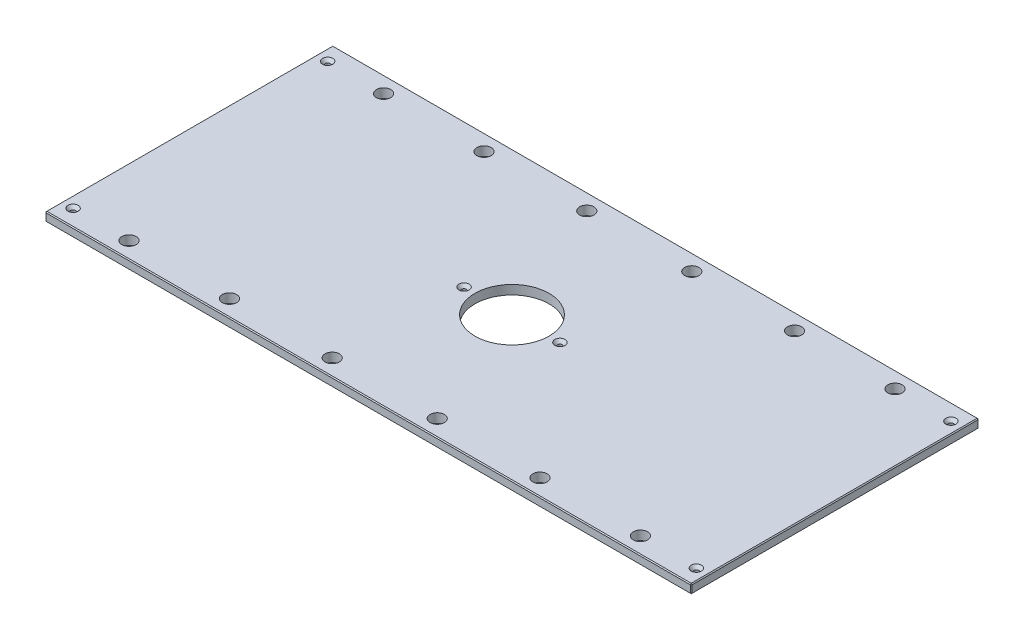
ISO-10303-21;
HEADER;
FILE_DESCRIPTION(('STEP AP214'),'2;1');
FILE_NAME('part.step','',(''),(''),'','','');
FILE_SCHEMA(('AUTOMOTIVE_DESIGN { 1 0 10303 214 1 1 1 1 }'));
ENDSEC;
DATA;
#1=APPLICATION_CONTEXT('core data for automotive mechanical design processes');
#2=APPLICATION_PROTOCOL_DEFINITION('international standard','automotive_design',2000,#1);
#3=PRODUCT_CONTEXT('',#1,'mechanical');
#4=PRODUCT('Part','Part','',(#3));
#5=PRODUCT_RELATED_PRODUCT_CATEGORY('part','',(#4));
#6=PRODUCT_DEFINITION_FORMATION('','',#4);
#7=PRODUCT_DEFINITION_CONTEXT('part definition',#1,'design');
#8=PRODUCT_DEFINITION('design','',#6,#7);
#9=PRODUCT_DEFINITION_SHAPE('','',#8);
#10=(LENGTH_UNIT() NAMED_UNIT(*) SI_UNIT(.MILLI.,.METRE.));
#11=(NAMED_UNIT(*) PLANE_ANGLE_UNIT() SI_UNIT($,.RADIAN.));
#12=(NAMED_UNIT(*) SI_UNIT($,.STERADIAN.) SOLID_ANGLE_UNIT());
#13=UNCERTAINTY_MEASURE_WITH_UNIT(LENGTH_MEASURE(1.E-05),#10,'distance_accuracy_value','');
#14=(GEOMETRIC_REPRESENTATION_CONTEXT(3) GLOBAL_UNCERTAINTY_ASSIGNED_CONTEXT((#13)) GLOBAL_UNIT_ASSIGNED_CONTEXT((#10,
#11,#12)) REPRESENTATION_CONTEXT('',''));
#15=CARTESIAN_POINT('',(0.,0.,0.));
#16=DIRECTION('',(0.,0.,1.));
#17=DIRECTION('',(1.,0.,0.));
#18=AXIS2_PLACEMENT_3D('',#15,#16,#17);
#19=CARTESIAN_POINT('',(-449.2625,12.7,-200.025));
#20=DIRECTION('',(1.,0.,0.));
#21=DIRECTION('',(0.,0.,-1.));
#22=AXIS2_PLACEMENT_3D('',#19,#20,#21);
#23=PLANE('',#22);
#24=DIRECTION('',(0.,0.,-1.));
#25=VECTOR('',#24,1.);
#26=CARTESIAN_POINT('',(-449.2625,11.4299999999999,-200.025));
#27=LINE('',#26,#25);
#28=CARTESIAN_POINT('',(-449.2625,11.4299999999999,198.755));
#29=VERTEX_POINT('',#28);
#30=CARTESIAN_POINT('',(-449.2625,11.4299999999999,-198.755));
#31=VERTEX_POINT('',#30);
#32=EDGE_CURVE('E135',#29,#31,#27,.T.);
#33=ORIENTED_EDGE('',*,*,#32,.T.);
#34=DIRECTION('',(0.,-1.,0.));
#35=VECTOR('',#34,1.);
#36=CARTESIAN_POINT('',(-449.2625,12.7,-198.755));
#37=LINE('',#36,#35);
#38=CARTESIAN_POINT('',(-449.2625,1.2700000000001,-198.755));
#39=VERTEX_POINT('',#38);
#40=EDGE_CURVE('E131',#31,#39,#37,.T.);
#41=ORIENTED_EDGE('',*,*,#40,.T.);
#42=DIRECTION('',(0.,0.,1.));
#43=VECTOR('',#42,1.);
#44=CARTESIAN_POINT('',(-449.2625,1.2700000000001,-200.025));
#45=LINE('',#44,#43);
#46=CARTESIAN_POINT('',(-449.2625,1.2700000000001,198.755));
#47=VERTEX_POINT('',#46);
#48=EDGE_CURVE('E126',#39,#47,#45,.T.);
#49=ORIENTED_EDGE('',*,*,#48,.T.);
#50=DIRECTION('',(0.,1.,0.));
#51=VECTOR('',#50,1.);
#52=CARTESIAN_POINT('',(-449.2625,12.7,198.755));
#53=LINE('',#52,#51);
#54=EDGE_CURVE('E128',#47,#29,#53,.T.);
#55=ORIENTED_EDGE('',*,*,#54,.T.);
#56=EDGE_LOOP('',(#33,#41,#49,#55));
#57=FACE_BOUND('',#56,.T.);
#58=ADVANCED_FACE('F35',(#57),#23,.F.);
#59=CARTESIAN_POINT('',(-449.2625,12.7,200.025));
#60=DIRECTION('',(0.,0.,-1.));
#61=DIRECTION('',(-1.,0.,0.));
#62=AXIS2_PLACEMENT_3D('',#59,#60,#61);
#63=PLANE('',#62);
#64=DIRECTION('',(1.,0.,0.));
#65=VECTOR('',#64,1.);
#66=CARTESIAN_POINT('',(-449.2625,1.2700000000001,200.025));
#67=LINE('',#66,#65);
#68=CARTESIAN_POINT('',(-447.9925,1.2700000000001,200.025));
#69=VERTEX_POINT('',#68);
#70=CARTESIAN_POINT('',(447.9925,1.2700000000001,200.025));
#71=VERTEX_POINT('',#70);
#72=EDGE_CURVE('E58',#69,#71,#67,.T.);
#73=ORIENTED_EDGE('',*,*,#72,.T.);
#74=DIRECTION('',(0.,1.,0.));
#75=VECTOR('',#74,1.);
#76=CARTESIAN_POINT('',(447.9925,12.7,200.025));
#77=LINE('',#76,#75);
#78=CARTESIAN_POINT('',(447.9925,11.4299999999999,200.025));
#79=VERTEX_POINT('',#78);
#80=EDGE_CURVE('E11',#71,#79,#77,.T.);
#81=ORIENTED_EDGE('',*,*,#80,.T.);
#82=DIRECTION('',(-1.,0.,0.));
#83=VECTOR('',#82,1.);
#84=CARTESIAN_POINT('',(-449.2625,11.4299999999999,200.025));
#85=LINE('',#84,#83);
#86=CARTESIAN_POINT('',(-447.9925,11.4299999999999,200.025));
#87=VERTEX_POINT('',#86);
#88=EDGE_CURVE('E44',#79,#87,#85,.T.);
#89=ORIENTED_EDGE('',*,*,#88,.T.);
#90=DIRECTION('',(0.,-1.,0.));
#91=VECTOR('',#90,1.);
#92=CARTESIAN_POINT('',(-447.9925,12.7,200.025));
#93=LINE('',#92,#91);
#94=EDGE_CURVE('E327',#87,#69,#93,.T.);
#95=ORIENTED_EDGE('',*,*,#94,.T.);
#96=EDGE_LOOP('',(#73,#81,#89,#95));
#97=FACE_BOUND('',#96,.T.);
#98=ADVANCED_FACE('F396',(#97),#63,.F.);
#99=CARTESIAN_POINT('',(449.2625,12.7,-200.025));
#100=DIRECTION('',(-1.,0.,0.));
#101=DIRECTION('',(0.,0.,1.));
#102=AXIS2_PLACEMENT_3D('',#99,#100,#101);
#103=PLANE('',#102);
#104=DIRECTION('',(0.,0.,-1.));
#105=VECTOR('',#104,1.);
#106=CARTESIAN_POINT('',(449.2625,1.2700000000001,-200.025));
#107=LINE('',#106,#105);
#108=CARTESIAN_POINT('',(449.2625,1.2700000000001,198.755));
#109=VERTEX_POINT('',#108);
#110=CARTESIAN_POINT('',(449.2625,1.2700000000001,-198.755));
#111=VERTEX_POINT('',#110);
#112=EDGE_CURVE('E322',#109,#111,#107,.T.);
#113=ORIENTED_EDGE('',*,*,#112,.T.);
#114=DIRECTION('',(0.,1.,0.));
#115=VECTOR('',#114,1.);
#116=CARTESIAN_POINT('',(449.2625,12.7,-198.755));
#117=LINE('',#116,#115);
#118=CARTESIAN_POINT('',(449.2625,11.4299999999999,-198.755));
#119=VERTEX_POINT('',#118);
#120=EDGE_CURVE('E324',#111,#119,#117,.T.);
#121=ORIENTED_EDGE('',*,*,#120,.T.);
#122=DIRECTION('',(0.,0.,1.));
#123=VECTOR('',#122,1.);
#124=CARTESIAN_POINT('',(449.2625,11.4299999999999,200.025));
#125=LINE('',#124,#123);
#126=CARTESIAN_POINT('',(449.2625,11.4299999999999,198.755));
#127=VERTEX_POINT('',#126);
#128=EDGE_CURVE('E320',#119,#127,#125,.T.);
#129=ORIENTED_EDGE('',*,*,#128,.T.);
#130=DIRECTION('',(0.,-1.,0.));
#131=VECTOR('',#130,1.);
#132=CARTESIAN_POINT('',(449.2625,12.7,198.755));
#133=LINE('',#132,#131);
#134=EDGE_CURVE('E318',#127,#109,#133,.T.);
#135=ORIENTED_EDGE('',*,*,#134,.T.);
#136=EDGE_LOOP('',(#113,#121,#129,#135));
#137=FACE_BOUND('',#136,.T.);
#138=ADVANCED_FACE('F383',(#137),#103,.F.);
#139=CARTESIAN_POINT('',(-449.2625,12.7,-200.025));
#140=DIRECTION('',(0.,0.,1.));
#141=DIRECTION('',(1.,0.,0.));
#142=AXIS2_PLACEMENT_3D('',#139,#140,#141);
#143=PLANE('',#142);
#144=DIRECTION('',(-1.,0.,0.));
#145=VECTOR('',#144,1.);
#146=CARTESIAN_POINT('',(-449.2625,1.2700000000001,-200.025));
#147=LINE('',#146,#145);
#148=CARTESIAN_POINT('',(447.9925,1.2700000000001,-200.025));
#149=VERTEX_POINT('',#148);
#150=CARTESIAN_POINT('',(-447.9925,1.2700000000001,-200.025));
#151=VERTEX_POINT('',#150);
#152=EDGE_CURVE('E294',#149,#151,#147,.T.);
#153=ORIENTED_EDGE('',*,*,#152,.T.);
#154=DIRECTION('',(0.,1.,0.));
#155=VECTOR('',#154,1.);
#156=CARTESIAN_POINT('',(-447.9925,12.7,-200.025));
#157=LINE('',#156,#155);
#158=CARTESIAN_POINT('',(-447.9925,11.4299999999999,-200.025));
#159=VERTEX_POINT('',#158);
#160=EDGE_CURVE('E298',#151,#159,#157,.T.);
#161=ORIENTED_EDGE('',*,*,#160,.T.);
#162=DIRECTION('',(1.,0.,0.));
#163=VECTOR('',#162,1.);
#164=CARTESIAN_POINT('',(449.2625,11.4299999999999,-200.025));
#165=LINE('',#164,#163);
#166=CARTESIAN_POINT('',(447.9925,11.4299999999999,-200.025));
#167=VERTEX_POINT('',#166);
#168=EDGE_CURVE('E296',#159,#167,#165,.T.);
#169=ORIENTED_EDGE('',*,*,#168,.T.);
#170=DIRECTION('',(0.,-1.,0.));
#171=VECTOR('',#170,1.);
#172=CARTESIAN_POINT('',(447.9925,12.7,-200.025));
#173=LINE('',#172,#171);
#174=EDGE_CURVE('E292',#167,#149,#173,.T.);
#175=ORIENTED_EDGE('',*,*,#174,.T.);
#176=EDGE_LOOP('',(#153,#161,#169,#175));
#177=FACE_BOUND('',#176,.T.);
#178=ADVANCED_FACE('F357',(#177),#143,.F.);
#179=CARTESIAN_POINT('',(0.,12.7,0.));
#180=DIRECTION('',(0.,1.,0.));
#181=DIRECTION('',(0.,0.,1.));
#182=AXIS2_PLACEMENT_3D('',#179,#180,#181);
#183=PLANE('',#182);
#184=CARTESIAN_POINT('',(433.3875,12.7,-177.00498));
#185=DIRECTION('',(0.,1.,0.));
#186=DIRECTION('',(0.,0.,1.));
#187=AXIS2_PLACEMENT_3D('',#184,#185,#186);
#188=CIRCLE('',#187,7.13740000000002);
#189=CARTESIAN_POINT('',(433.3875,12.7,-169.86758));
#190=VERTEX_POINT('',#189);
#191=EDGE_CURVE('E880',#190,#190,#188,.T.);
#192=ORIENTED_EDGE('',*,*,#191,.F.);
#193=EDGE_LOOP('',(#192));
#194=FACE_BOUND('',#193,.T.);
#195=CARTESIAN_POINT('',(433.3875,12.7,177.00498));
#196=DIRECTION('',(0.,1.,0.));
#197=DIRECTION('',(0.,0.,1.));
#198=AXIS2_PLACEMENT_3D('',#195,#196,#197);
#199=CIRCLE('',#198,7.13740000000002);
#200=CARTESIAN_POINT('',(433.3875,12.7,184.14238));
#201=VERTEX_POINT('',#200);
#202=EDGE_CURVE('E884',#201,#201,#199,.T.);
#203=ORIENTED_EDGE('',*,*,#202,.F.);
#204=EDGE_LOOP('',(#203));
#205=FACE_BOUND('',#204,.T.);
#206=CARTESIAN_POINT('',(-433.3875,12.7,177.00498));
#207=DIRECTION('',(0.,1.,0.));
#208=DIRECTION('',(0.,0.,1.));
#209=AXIS2_PLACEMENT_3D('',#206,#207,#208);
#210=CIRCLE('',#209,7.13740000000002);
#211=CARTESIAN_POINT('',(-433.3875,12.7,184.14238));
#212=VERTEX_POINT('',#211);
#213=EDGE_CURVE('E888',#212,#212,#210,.T.);
#214=ORIENTED_EDGE('',*,*,#213,.F.);
#215=EDGE_LOOP('',(#214));
#216=FACE_BOUND('',#215,.T.);
#217=CARTESIAN_POINT('',(-66.675,12.7,0.));
#218=DIRECTION('',(0.,1.,0.));
#219=DIRECTION('',(0.,0.,1.));
#220=AXIS2_PLACEMENT_3D('',#217,#218,#219);
#221=CIRCLE('',#220,7.1374);
#222=CARTESIAN_POINT('',(-66.675,12.7,7.1374));
#223=VERTEX_POINT('',#222);
#224=EDGE_CURVE('E892',#223,#223,#221,.T.);
#225=ORIENTED_EDGE('',*,*,#224,.F.);
#226=EDGE_LOOP('',(#225));
#227=FACE_BOUND('',#226,.T.);
#228=CARTESIAN_POINT('',(66.675,12.7,0.));
#229=DIRECTION('',(0.,1.,0.));
#230=DIRECTION('',(0.,0.,1.));
#231=AXIS2_PLACEMENT_3D('',#228,#229,#230);
#232=CIRCLE('',#231,7.1374);
#233=CARTESIAN_POINT('',(66.675,12.7,7.1374));
#234=VERTEX_POINT('',#233);
#235=EDGE_CURVE('E896',#234,#234,#232,.T.);
#236=ORIENTED_EDGE('',*,*,#235,.F.);
#237=EDGE_LOOP('',(#236));
#238=FACE_BOUND('',#237,.T.);
#239=CARTESIAN_POINT('',(-433.3875,12.7,-177.00498));
#240=DIRECTION('',(0.,1.,0.));
#241=DIRECTION('',(0.,0.,1.));
#242=AXIS2_PLACEMENT_3D('',#239,#240,#241);
#243=CIRCLE('',#242,7.13740000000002);
#244=CARTESIAN_POINT('',(-433.3875,12.7,-169.86758));
#245=VERTEX_POINT('',#244);
#246=EDGE_CURVE('E899',#245,#245,#243,.T.);
#247=ORIENTED_EDGE('',*,*,#246,.F.);
#248=EDGE_LOOP('',(#247));
#249=FACE_BOUND('',#248,.T.);
#250=DIRECTION('',(0.,0.,-1.));
#251=VECTOR('',#250,1.);
#252=CARTESIAN_POINT('',(447.9925,12.7,-200.025));
#253=LINE('',#252,#251);
#254=CARTESIAN_POINT('',(447.9925,12.7,198.755));
#255=VERTEX_POINT('',#254);
#256=CARTESIAN_POINT('',(447.9925,12.7,-198.755));
#257=VERTEX_POINT('',#256);
#258=EDGE_CURVE('E305',#255,#257,#253,.T.);
#259=ORIENTED_EDGE('',*,*,#258,.T.);
#260=DIRECTION('',(-1.,0.,0.));
#261=VECTOR('',#260,1.);
#262=CARTESIAN_POINT('',(-449.2625,12.7,-198.755));
#263=LINE('',#262,#261);
#264=CARTESIAN_POINT('',(-447.9925,12.7,-198.755));
#265=VERTEX_POINT('',#264);
#266=EDGE_CURVE('E307',#257,#265,#263,.T.);
#267=ORIENTED_EDGE('',*,*,#266,.T.);
#268=DIRECTION('',(0.,0.,1.));
#269=VECTOR('',#268,1.);
#270=CARTESIAN_POINT('',(-447.9925,12.7,200.025));
#271=LINE('',#270,#269);
#272=CARTESIAN_POINT('',(-447.9925,12.7,198.755));
#273=VERTEX_POINT('',#272);
#274=EDGE_CURVE('E303',#265,#273,#271,.T.);
#275=ORIENTED_EDGE('',*,*,#274,.T.);
#276=DIRECTION('',(1.,0.,0.));
#277=VECTOR('',#276,1.);
#278=CARTESIAN_POINT('',(449.2625,12.7,198.755));
#279=LINE('',#278,#277);
#280=EDGE_CURVE('E301',#273,#255,#279,.T.);
#281=ORIENTED_EDGE('',*,*,#280,.T.);
#282=EDGE_LOOP('',(#259,#267,#275,#281));
#283=FACE_BOUND('',#282,.T.);
#284=CARTESIAN_POINT('',(355.6,12.7,-177.00498));
#285=DIRECTION('',(0.,1.,0.));
#286=DIRECTION('',(0.,0.,1.));
#287=AXIS2_PLACEMENT_3D('',#284,#285,#286);
#288=CIRCLE('',#287,9.92187500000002);
#289=CARTESIAN_POINT('',(355.6,12.7,-167.083105));
#290=VERTEX_POINT('',#289);
#291=EDGE_CURVE('E204',#290,#290,#288,.T.);
#292=ORIENTED_EDGE('',*,*,#291,.F.);
#293=EDGE_LOOP('',(#292));
#294=FACE_BOUND('',#293,.T.);
#295=CARTESIAN_POINT('',(-355.6,12.7,-177.00498));
#296=DIRECTION('',(0.,1.,0.));
#297=DIRECTION('',(0.,0.,1.));
#298=AXIS2_PLACEMENT_3D('',#295,#296,#297);
#299=CIRCLE('',#298,9.92187500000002);
#300=CARTESIAN_POINT('',(-355.6,12.7,-167.083105));
#301=VERTEX_POINT('',#300);
#302=EDGE_CURVE('E214',#301,#301,#299,.T.);
#303=ORIENTED_EDGE('',*,*,#302,.F.);
#304=EDGE_LOOP('',(#303));
#305=FACE_BOUND('',#304,.T.);
#306=CARTESIAN_POINT('',(355.6,12.7,177.00498));
#307=DIRECTION('',(0.,1.,0.));
#308=DIRECTION('',(0.,0.,1.));
#309=AXIS2_PLACEMENT_3D('',#306,#307,#308);
#310=CIRCLE('',#309,9.92187500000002);
#311=CARTESIAN_POINT('',(355.6,12.7,186.926855));
#312=VERTEX_POINT('',#311);
#313=EDGE_CURVE('E225',#312,#312,#310,.T.);
#314=ORIENTED_EDGE('',*,*,#313,.F.);
#315=EDGE_LOOP('',(#314));
#316=FACE_BOUND('',#315,.T.);
#317=CARTESIAN_POINT('',(-355.6,12.7,177.00498));
#318=DIRECTION('',(0.,1.,0.));
#319=DIRECTION('',(0.,0.,1.));
#320=AXIS2_PLACEMENT_3D('',#317,#318,#319);
#321=CIRCLE('',#320,9.92187500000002);
#322=CARTESIAN_POINT('',(-355.6,12.7,186.926855));
#323=VERTEX_POINT('',#322);
#324=EDGE_CURVE('E231',#323,#323,#321,.T.);
#325=ORIENTED_EDGE('',*,*,#324,.F.);
#326=EDGE_LOOP('',(#325));
#327=FACE_BOUND('',#326,.T.);
#328=CARTESIAN_POINT('',(-215.9,12.7,-177.00498));
#329=DIRECTION('',(0.,1.,0.));
#330=DIRECTION('',(0.,0.,1.));
#331=AXIS2_PLACEMENT_3D('',#328,#329,#330);
#332=CIRCLE('',#331,9.921875);
#333=CARTESIAN_POINT('',(-215.9,12.7,-167.083105));
#334=VERTEX_POINT('',#333);
#335=EDGE_CURVE('E237',#334,#334,#332,.T.);
#336=ORIENTED_EDGE('',*,*,#335,.F.);
#337=EDGE_LOOP('',(#336));
#338=FACE_BOUND('',#337,.T.);
#339=CARTESIAN_POINT('',(215.9,12.7,-177.00498));
#340=DIRECTION('',(0.,1.,0.));
#341=DIRECTION('',(0.,0.,1.));
#342=AXIS2_PLACEMENT_3D('',#339,#340,#341);
#343=CIRCLE('',#342,9.921875);
#344=CARTESIAN_POINT('',(215.9,12.7,-167.083105));
#345=VERTEX_POINT('',#344);
#346=EDGE_CURVE('E243',#345,#345,#343,.T.);
#347=ORIENTED_EDGE('',*,*,#346,.F.);
#348=EDGE_LOOP('',(#347));
#349=FACE_BOUND('',#348,.T.);
#350=CARTESIAN_POINT('',(215.9,12.7,177.00498));
#351=DIRECTION('',(0.,1.,0.));
#352=DIRECTION('',(0.,0.,1.));
#353=AXIS2_PLACEMENT_3D('',#350,#351,#352);
#354=CIRCLE('',#353,9.921875);
#355=CARTESIAN_POINT('',(215.9,12.7,186.926855));
#356=VERTEX_POINT('',#355);
#357=EDGE_CURVE('E249',#356,#356,#354,.T.);
#358=ORIENTED_EDGE('',*,*,#357,.F.);
#359=EDGE_LOOP('',(#358));
#360=FACE_BOUND('',#359,.T.);
#361=CARTESIAN_POINT('',(-215.9,12.7,177.00498));
#362=DIRECTION('',(0.,1.,0.));
#363=DIRECTION('',(0.,0.,1.));
#364=AXIS2_PLACEMENT_3D('',#361,#362,#363);
#365=CIRCLE('',#364,9.921875);
#366=CARTESIAN_POINT('',(-215.9,12.7,186.926855));
#367=VERTEX_POINT('',#366);
#368=EDGE_CURVE('E255',#367,#367,#365,.T.);
#369=ORIENTED_EDGE('',*,*,#368,.F.);
#370=EDGE_LOOP('',(#369));
#371=FACE_BOUND('',#370,.T.);
#372=CARTESIAN_POINT('',(73.025,12.7,-177.00498));
#373=DIRECTION('',(0.,1.,0.));
#374=DIRECTION('',(0.,0.,1.));
#375=AXIS2_PLACEMENT_3D('',#372,#373,#374);
#376=CIRCLE('',#375,9.921875);
#377=CARTESIAN_POINT('',(73.025,12.7,-167.083105));
#378=VERTEX_POINT('',#377);
#379=EDGE_CURVE('E261',#378,#378,#376,.T.);
#380=ORIENTED_EDGE('',*,*,#379,.F.);
#381=EDGE_LOOP('',(#380));
#382=FACE_BOUND('',#381,.T.);
#383=CARTESIAN_POINT('',(-73.025,12.7,-177.00498));
#384=DIRECTION('',(0.,1.,0.));
#385=DIRECTION('',(0.,0.,1.));
#386=AXIS2_PLACEMENT_3D('',#383,#384,#385);
#387=CIRCLE('',#386,9.921875);
#388=CARTESIAN_POINT('',(-73.025,12.7,-167.083105));
#389=VERTEX_POINT('',#388);
#390=EDGE_CURVE('E267',#389,#389,#387,.T.);
#391=ORIENTED_EDGE('',*,*,#390,.F.);
#392=EDGE_LOOP('',(#391));
#393=FACE_BOUND('',#392,.T.);
#394=CARTESIAN_POINT('',(-73.025,12.7,177.00498));
#395=DIRECTION('',(0.,1.,0.));
#396=DIRECTION('',(0.,0.,1.));
#397=AXIS2_PLACEMENT_3D('',#394,#395,#396);
#398=CIRCLE('',#397,9.921875);
#399=CARTESIAN_POINT('',(-73.025,12.7,186.926855));
#400=VERTEX_POINT('',#399);
#401=EDGE_CURVE('E273',#400,#400,#398,.T.);
#402=ORIENTED_EDGE('',*,*,#401,.F.);
#403=EDGE_LOOP('',(#402));
#404=FACE_BOUND('',#403,.T.);
#405=CARTESIAN_POINT('',(73.025,12.7,177.00498));
#406=DIRECTION('',(0.,1.,0.));
#407=DIRECTION('',(0.,0.,1.));
#408=AXIS2_PLACEMENT_3D('',#405,#406,#407);
#409=CIRCLE('',#408,9.921875);
#410=CARTESIAN_POINT('',(73.025,12.7,186.926855));
#411=VERTEX_POINT('',#410);
#412=EDGE_CURVE('E279',#411,#411,#409,.T.);
#413=ORIENTED_EDGE('',*,*,#412,.F.);
#414=EDGE_LOOP('',(#413));
#415=FACE_BOUND('',#414,.T.);
#416=CARTESIAN_POINT('',(0.,12.7,0.));
#417=DIRECTION('',(0.,1.,0.));
#418=DIRECTION('',(0.,0.,1.));
#419=AXIS2_PLACEMENT_3D('',#416,#417,#418);
#420=CIRCLE('',#419,51.562);
#421=CARTESIAN_POINT('',(0.,12.7,51.562));
#422=VERTEX_POINT('',#421);
#423=EDGE_CURVE('E285',#422,#422,#420,.T.);
#424=ORIENTED_EDGE('',*,*,#423,.F.);
#425=EDGE_LOOP('',(#424));
#426=FACE_BOUND('',#425,.T.);
#427=ADVANCED_FACE('F405',(#194,#205,#216,#227,#238,#249,#283,#294,#305,#316,#327,#338,#349,
#360,#371,#382,#393,#404,#415,#426),#183,.T.);
#428=CARTESIAN_POINT('',(0.,0.,0.));
#429=DIRECTION('',(0.,1.,0.));
#430=DIRECTION('',(0.,0.,1.));
#431=AXIS2_PLACEMENT_3D('',#428,#429,#430);
#432=PLANE('',#431);
#433=CARTESIAN_POINT('',(433.3875,0.,-177.00498));
#434=DIRECTION('',(0.,1.,0.));
#435=DIRECTION('',(0.,0.,1.));
#436=AXIS2_PLACEMENT_3D('',#433,#434,#435);
#437=CIRCLE('',#436,3.3782);
#438=CARTESIAN_POINT('',(433.3875,0.,-173.62678));
#439=VERTEX_POINT('',#438);
#440=EDGE_CURVE('E933',#439,#439,#437,.T.);
#441=ORIENTED_EDGE('',*,*,#440,.T.);
#442=EDGE_LOOP('',(#441));
#443=FACE_BOUND('',#442,.T.);
#444=CARTESIAN_POINT('',(433.3875,0.,177.00498));
#445=DIRECTION('',(0.,1.,0.));
#446=DIRECTION('',(0.,0.,1.));
#447=AXIS2_PLACEMENT_3D('',#444,#445,#446);
#448=CIRCLE('',#447,3.3782);
#449=CARTESIAN_POINT('',(433.3875,0.,180.38318));
#450=VERTEX_POINT('',#449);
#451=EDGE_CURVE('E926',#450,#450,#448,.T.);
#452=ORIENTED_EDGE('',*,*,#451,.T.);
#453=EDGE_LOOP('',(#452));
#454=FACE_BOUND('',#453,.T.);
#455=CARTESIAN_POINT('',(-433.3875,0.,177.00498));
#456=DIRECTION('',(0.,1.,0.));
#457=DIRECTION('',(0.,0.,1.));
#458=AXIS2_PLACEMENT_3D('',#455,#456,#457);
#459=CIRCLE('',#458,3.3782);
#460=CARTESIAN_POINT('',(-433.3875,0.,180.38318));
#461=VERTEX_POINT('',#460);
#462=EDGE_CURVE('E919',#461,#461,#459,.T.);
#463=ORIENTED_EDGE('',*,*,#462,.T.);
#464=EDGE_LOOP('',(#463));
#465=FACE_BOUND('',#464,.T.);
#466=CARTESIAN_POINT('',(-66.675,0.,0.));
#467=DIRECTION('',(0.,1.,0.));
#468=DIRECTION('',(0.,0.,1.));
#469=AXIS2_PLACEMENT_3D('',#466,#467,#468);
#470=CIRCLE('',#469,3.3782);
#471=CARTESIAN_POINT('',(-66.675,0.,3.3782));
#472=VERTEX_POINT('',#471);
#473=EDGE_CURVE('E912',#472,#472,#470,.T.);
#474=ORIENTED_EDGE('',*,*,#473,.T.);
#475=EDGE_LOOP('',(#474));
#476=FACE_BOUND('',#475,.T.);
#477=CARTESIAN_POINT('',(66.675,0.,0.));
#478=DIRECTION('',(0.,1.,0.));
#479=DIRECTION('',(0.,0.,1.));
#480=AXIS2_PLACEMENT_3D('',#477,#478,#479);
#481=CIRCLE('',#480,3.3782);
#482=CARTESIAN_POINT('',(66.675,0.,3.3782));
#483=VERTEX_POINT('',#482);
#484=EDGE_CURVE('E902',#483,#483,#481,.T.);
#485=ORIENTED_EDGE('',*,*,#484,.T.);
#486=EDGE_LOOP('',(#485));
#487=FACE_BOUND('',#486,.T.);
#488=CARTESIAN_POINT('',(-433.3875,0.,-177.00498));
#489=DIRECTION('',(0.,1.,0.));
#490=DIRECTION('',(0.,0.,1.));
#491=AXIS2_PLACEMENT_3D('',#488,#489,#490);
#492=CIRCLE('',#491,3.3782);
#493=CARTESIAN_POINT('',(-433.3875,0.,-173.62678));
#494=VERTEX_POINT('',#493);
#495=EDGE_CURVE('E217',#494,#494,#492,.T.);
#496=ORIENTED_EDGE('',*,*,#495,.T.);
#497=EDGE_LOOP('',(#496));
#498=FACE_BOUND('',#497,.T.);
#499=DIRECTION('',(0.,0.,-1.));
#500=VECTOR('',#499,1.);
#501=CARTESIAN_POINT('',(-447.9925,0.,0.));
#502=LINE('',#501,#500);
#503=CARTESIAN_POINT('',(-447.9925,0.,198.755));
#504=VERTEX_POINT('',#503);
#505=CARTESIAN_POINT('',(-447.9925,0.,-198.755));
#506=VERTEX_POINT('',#505);
#507=EDGE_CURVE('E158',#504,#506,#502,.T.);
#508=ORIENTED_EDGE('',*,*,#507,.T.);
#509=DIRECTION('',(1.,0.,0.));
#510=VECTOR('',#509,1.);
#511=CARTESIAN_POINT('',(0.,0.,-198.755));
#512=LINE('',#511,#510);
#513=CARTESIAN_POINT('',(447.9925,0.,-198.755));
#514=VERTEX_POINT('',#513);
#515=EDGE_CURVE('E315',#506,#514,#512,.T.);
#516=ORIENTED_EDGE('',*,*,#515,.T.);
#517=DIRECTION('',(0.,0.,1.));
#518=VECTOR('',#517,1.);
#519=CARTESIAN_POINT('',(447.9925,0.,0.));
#520=LINE('',#519,#518);
#521=CARTESIAN_POINT('',(447.9925,0.,198.755));
#522=VERTEX_POINT('',#521);
#523=EDGE_CURVE('E313',#514,#522,#520,.T.);
#524=ORIENTED_EDGE('',*,*,#523,.T.);
#525=DIRECTION('',(-1.,0.,0.));
#526=VECTOR('',#525,1.);
#527=CARTESIAN_POINT('',(0.,0.,198.755));
#528=LINE('',#527,#526);
#529=EDGE_CURVE('E310',#522,#504,#528,.T.);
#530=ORIENTED_EDGE('',*,*,#529,.T.);
#531=EDGE_LOOP('',(#508,#516,#524,#530));
#532=FACE_BOUND('',#531,.T.);
#533=CARTESIAN_POINT('',(355.6,0.,-177.00498));
#534=DIRECTION('',(0.,1.,0.));
#535=DIRECTION('',(0.,0.,1.));
#536=AXIS2_PLACEMENT_3D('',#533,#534,#535);
#537=CIRCLE('',#536,9.92187500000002);
#538=CARTESIAN_POINT('',(355.6,0.,-167.083105));
#539=VERTEX_POINT('',#538);
#540=EDGE_CURVE('E209',#539,#539,#537,.T.);
#541=ORIENTED_EDGE('',*,*,#540,.T.);
#542=EDGE_LOOP('',(#541));
#543=FACE_BOUND('',#542,.T.);
#544=CARTESIAN_POINT('',(-355.6,0.,-177.00498));
#545=DIRECTION('',(0.,1.,0.));
#546=DIRECTION('',(0.,0.,1.));
#547=AXIS2_PLACEMENT_3D('',#544,#545,#546);
#548=CIRCLE('',#547,9.92187500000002);
#549=CARTESIAN_POINT('',(-355.6,0.,-167.083105));
#550=VERTEX_POINT('',#549);
#551=EDGE_CURVE('E222',#550,#550,#548,.T.);
#552=ORIENTED_EDGE('',*,*,#551,.T.);
#553=EDGE_LOOP('',(#552));
#554=FACE_BOUND('',#553,.T.);
#555=CARTESIAN_POINT('',(355.6,0.,177.00498));
#556=DIRECTION('',(0.,1.,0.));
#557=DIRECTION('',(0.,0.,1.));
#558=AXIS2_PLACEMENT_3D('',#555,#556,#557);
#559=CIRCLE('',#558,9.92187500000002);
#560=CARTESIAN_POINT('',(355.6,0.,186.926855));
#561=VERTEX_POINT('',#560);
#562=EDGE_CURVE('E228',#561,#561,#559,.T.);
#563=ORIENTED_EDGE('',*,*,#562,.T.);
#564=EDGE_LOOP('',(#563));
#565=FACE_BOUND('',#564,.T.);
#566=CARTESIAN_POINT('',(-355.6,0.,177.00498));
#567=DIRECTION('',(0.,1.,0.));
#568=DIRECTION('',(0.,0.,1.));
#569=AXIS2_PLACEMENT_3D('',#566,#567,#568);
#570=CIRCLE('',#569,9.92187500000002);
#571=CARTESIAN_POINT('',(-355.6,0.,186.926855));
#572=VERTEX_POINT('',#571);
#573=EDGE_CURVE('E234',#572,#572,#570,.T.);
#574=ORIENTED_EDGE('',*,*,#573,.T.);
#575=EDGE_LOOP('',(#574));
#576=FACE_BOUND('',#575,.T.);
#577=CARTESIAN_POINT('',(-215.9,0.,-177.00498));
#578=DIRECTION('',(0.,1.,0.));
#579=DIRECTION('',(0.,0.,1.));
#580=AXIS2_PLACEMENT_3D('',#577,#578,#579);
#581=CIRCLE('',#580,9.921875);
#582=CARTESIAN_POINT('',(-215.9,0.,-167.083105));
#583=VERTEX_POINT('',#582);
#584=EDGE_CURVE('E240',#583,#583,#581,.T.);
#585=ORIENTED_EDGE('',*,*,#584,.T.);
#586=EDGE_LOOP('',(#585));
#587=FACE_BOUND('',#586,.T.);
#588=CARTESIAN_POINT('',(215.9,0.,-177.00498));
#589=DIRECTION('',(0.,1.,0.));
#590=DIRECTION('',(0.,0.,1.));
#591=AXIS2_PLACEMENT_3D('',#588,#589,#590);
#592=CIRCLE('',#591,9.921875);
#593=CARTESIAN_POINT('',(215.9,0.,-167.083105));
#594=VERTEX_POINT('',#593);
#595=EDGE_CURVE('E246',#594,#594,#592,.T.);
#596=ORIENTED_EDGE('',*,*,#595,.T.);
#597=EDGE_LOOP('',(#596));
#598=FACE_BOUND('',#597,.T.);
#599=CARTESIAN_POINT('',(215.9,0.,177.00498));
#600=DIRECTION('',(0.,1.,0.));
#601=DIRECTION('',(0.,0.,1.));
#602=AXIS2_PLACEMENT_3D('',#599,#600,#601);
#603=CIRCLE('',#602,9.921875);
#604=CARTESIAN_POINT('',(215.9,0.,186.926855));
#605=VERTEX_POINT('',#604);
#606=EDGE_CURVE('E252',#605,#605,#603,.T.);
#607=ORIENTED_EDGE('',*,*,#606,.T.);
#608=EDGE_LOOP('',(#607));
#609=FACE_BOUND('',#608,.T.);
#610=CARTESIAN_POINT('',(-215.9,0.,177.00498));
#611=DIRECTION('',(0.,1.,0.));
#612=DIRECTION('',(0.,0.,1.));
#613=AXIS2_PLACEMENT_3D('',#610,#611,#612);
#614=CIRCLE('',#613,9.921875);
#615=CARTESIAN_POINT('',(-215.9,0.,186.926855));
#616=VERTEX_POINT('',#615);
#617=EDGE_CURVE('E258',#616,#616,#614,.T.);
#618=ORIENTED_EDGE('',*,*,#617,.T.);
#619=EDGE_LOOP('',(#618));
#620=FACE_BOUND('',#619,.T.);
#621=CARTESIAN_POINT('',(73.025,0.,-177.00498));
#622=DIRECTION('',(0.,1.,0.));
#623=DIRECTION('',(0.,0.,1.));
#624=AXIS2_PLACEMENT_3D('',#621,#622,#623);
#625=CIRCLE('',#624,9.921875);
#626=CARTESIAN_POINT('',(73.025,0.,-167.083105));
#627=VERTEX_POINT('',#626);
#628=EDGE_CURVE('E264',#627,#627,#625,.T.);
#629=ORIENTED_EDGE('',*,*,#628,.T.);
#630=EDGE_LOOP('',(#629));
#631=FACE_BOUND('',#630,.T.);
#632=CARTESIAN_POINT('',(-73.025,0.,-177.00498));
#633=DIRECTION('',(0.,1.,0.));
#634=DIRECTION('',(0.,0.,1.));
#635=AXIS2_PLACEMENT_3D('',#632,#633,#634);
#636=CIRCLE('',#635,9.921875);
#637=CARTESIAN_POINT('',(-73.025,0.,-167.083105));
#638=VERTEX_POINT('',#637);
#639=EDGE_CURVE('E270',#638,#638,#636,.T.);
#640=ORIENTED_EDGE('',*,*,#639,.T.);
#641=EDGE_LOOP('',(#640));
#642=FACE_BOUND('',#641,.T.);
#643=CARTESIAN_POINT('',(-73.025,0.,177.00498));
#644=DIRECTION('',(0.,1.,0.));
#645=DIRECTION('',(0.,0.,1.));
#646=AXIS2_PLACEMENT_3D('',#643,#644,#645);
#647=CIRCLE('',#646,9.921875);
#648=CARTESIAN_POINT('',(-73.025,0.,186.926855));
#649=VERTEX_POINT('',#648);
#650=EDGE_CURVE('E276',#649,#649,#647,.T.);
#651=ORIENTED_EDGE('',*,*,#650,.T.);
#652=EDGE_LOOP('',(#651));
#653=FACE_BOUND('',#652,.T.);
#654=CARTESIAN_POINT('',(73.025,0.,177.00498));
#655=DIRECTION('',(0.,1.,0.));
#656=DIRECTION('',(0.,0.,1.));
#657=AXIS2_PLACEMENT_3D('',#654,#655,#656);
#658=CIRCLE('',#657,9.921875);
#659=CARTESIAN_POINT('',(73.025,0.,186.926855));
#660=VERTEX_POINT('',#659);
#661=EDGE_CURVE('E282',#660,#660,#658,.T.);
#662=ORIENTED_EDGE('',*,*,#661,.T.);
#663=EDGE_LOOP('',(#662));
#664=FACE_BOUND('',#663,.T.);
#665=CARTESIAN_POINT('',(0.,0.,0.));
#666=DIRECTION('',(0.,1.,0.));
#667=DIRECTION('',(0.,0.,1.));
#668=AXIS2_PLACEMENT_3D('',#665,#666,#667);
#669=CIRCLE('',#668,51.562);
#670=CARTESIAN_POINT('',(0.,0.,51.562));
#671=VERTEX_POINT('',#670);
#672=EDGE_CURVE('E147',#671,#671,#669,.T.);
#673=ORIENTED_EDGE('',*,*,#672,.T.);
#674=EDGE_LOOP('',(#673));
#675=FACE_BOUND('',#674,.T.);
#676=ADVANCED_FACE('F370',(#443,#454,#465,#476,#487,#498,#532,#543,#554,#565,#576,#587,#598,
#609,#620,#631,#642,#653,#664,#675),#432,.F.);
#677=CARTESIAN_POINT('',(0.,0.,0.));
#678=DIRECTION('',(0.,1.,0.));
#679=DIRECTION('',(0.,0.,1.));
#680=AXIS2_PLACEMENT_3D('',#677,#678,#679);
#681=CYLINDRICAL_SURFACE('',#680,51.562);
#682=ORIENTED_EDGE('',*,*,#672,.F.);
#683=EDGE_LOOP('',(#682));
#684=FACE_BOUND('',#683,.T.);
#685=ORIENTED_EDGE('',*,*,#423,.T.);
#686=EDGE_LOOP('',(#685));
#687=FACE_BOUND('',#686,.T.);
#688=ADVANCED_FACE('F811',(#684,#687),#681,.F.);
#689=CARTESIAN_POINT('',(73.025,12.7,177.00498));
#690=DIRECTION('',(0.,1.,0.));
#691=DIRECTION('',(0.,0.,1.));
#692=AXIS2_PLACEMENT_3D('',#689,#690,#691);
#693=CYLINDRICAL_SURFACE('',#692,9.921875);
#694=ORIENTED_EDGE('',*,*,#661,.F.);
#695=EDGE_LOOP('',(#694));
#696=FACE_BOUND('',#695,.T.);
#697=ORIENTED_EDGE('',*,*,#412,.T.);
#698=EDGE_LOOP('',(#697));
#699=FACE_BOUND('',#698,.T.);
#700=ADVANCED_FACE('F802',(#696,#699),#693,.F.);
#701=CARTESIAN_POINT('',(-73.025,12.7,177.00498));
#702=DIRECTION('',(0.,1.,0.));
#703=DIRECTION('',(0.,0.,1.));
#704=AXIS2_PLACEMENT_3D('',#701,#702,#703);
#705=CYLINDRICAL_SURFACE('',#704,9.921875);
#706=ORIENTED_EDGE('',*,*,#650,.F.);
#707=EDGE_LOOP('',(#706));
#708=FACE_BOUND('',#707,.T.);
#709=ORIENTED_EDGE('',*,*,#401,.T.);
#710=EDGE_LOOP('',(#709));
#711=FACE_BOUND('',#710,.T.);
#712=ADVANCED_FACE('F793',(#708,#711),#705,.F.);
#713=CARTESIAN_POINT('',(-73.025,12.7,-177.00498));
#714=DIRECTION('',(0.,1.,0.));
#715=DIRECTION('',(0.,0.,1.));
#716=AXIS2_PLACEMENT_3D('',#713,#714,#715);
#717=CYLINDRICAL_SURFACE('',#716,9.921875);
#718=ORIENTED_EDGE('',*,*,#639,.F.);
#719=EDGE_LOOP('',(#718));
#720=FACE_BOUND('',#719,.T.);
#721=ORIENTED_EDGE('',*,*,#390,.T.);
#722=EDGE_LOOP('',(#721));
#723=FACE_BOUND('',#722,.T.);
#724=ADVANCED_FACE('F784',(#720,#723),#717,.F.);
#725=CARTESIAN_POINT('',(73.025,12.7,-177.00498));
#726=DIRECTION('',(0.,1.,0.));
#727=DIRECTION('',(0.,0.,1.));
#728=AXIS2_PLACEMENT_3D('',#725,#726,#727);
#729=CYLINDRICAL_SURFACE('',#728,9.921875);
#730=ORIENTED_EDGE('',*,*,#628,.F.);
#731=EDGE_LOOP('',(#730));
#732=FACE_BOUND('',#731,.T.);
#733=ORIENTED_EDGE('',*,*,#379,.T.);
#734=EDGE_LOOP('',(#733));
#735=FACE_BOUND('',#734,.T.);
#736=ADVANCED_FACE('F775',(#732,#735),#729,.F.);
#737=CARTESIAN_POINT('',(-215.9,12.7,177.00498));
#738=DIRECTION('',(0.,1.,0.));
#739=DIRECTION('',(0.,0.,1.));
#740=AXIS2_PLACEMENT_3D('',#737,#738,#739);
#741=CYLINDRICAL_SURFACE('',#740,9.921875);
#742=ORIENTED_EDGE('',*,*,#617,.F.);
#743=EDGE_LOOP('',(#742));
#744=FACE_BOUND('',#743,.T.);
#745=ORIENTED_EDGE('',*,*,#368,.T.);
#746=EDGE_LOOP('',(#745));
#747=FACE_BOUND('',#746,.T.);
#748=ADVANCED_FACE('F766',(#744,#747),#741,.F.);
#749=CARTESIAN_POINT('',(215.9,12.7,177.00498));
#750=DIRECTION('',(0.,1.,0.));
#751=DIRECTION('',(0.,0.,1.));
#752=AXIS2_PLACEMENT_3D('',#749,#750,#751);
#753=CYLINDRICAL_SURFACE('',#752,9.921875);
#754=ORIENTED_EDGE('',*,*,#606,.F.);
#755=EDGE_LOOP('',(#754));
#756=FACE_BOUND('',#755,.T.);
#757=ORIENTED_EDGE('',*,*,#357,.T.);
#758=EDGE_LOOP('',(#757));
#759=FACE_BOUND('',#758,.T.);
#760=ADVANCED_FACE('F757',(#756,#759),#753,.F.);
#761=CARTESIAN_POINT('',(215.9,12.7,-177.00498));
#762=DIRECTION('',(0.,1.,0.));
#763=DIRECTION('',(0.,0.,1.));
#764=AXIS2_PLACEMENT_3D('',#761,#762,#763);
#765=CYLINDRICAL_SURFACE('',#764,9.921875);
#766=ORIENTED_EDGE('',*,*,#595,.F.);
#767=EDGE_LOOP('',(#766));
#768=FACE_BOUND('',#767,.T.);
#769=ORIENTED_EDGE('',*,*,#346,.T.);
#770=EDGE_LOOP('',(#769));
#771=FACE_BOUND('',#770,.T.);
#772=ADVANCED_FACE('F748',(#768,#771),#765,.F.);
#773=CARTESIAN_POINT('',(-215.9,12.7,-177.00498));
#774=DIRECTION('',(0.,1.,0.));
#775=DIRECTION('',(0.,0.,1.));
#776=AXIS2_PLACEMENT_3D('',#773,#774,#775);
#777=CYLINDRICAL_SURFACE('',#776,9.921875);
#778=ORIENTED_EDGE('',*,*,#584,.F.);
#779=EDGE_LOOP('',(#778));
#780=FACE_BOUND('',#779,.T.);
#781=ORIENTED_EDGE('',*,*,#335,.T.);
#782=EDGE_LOOP('',(#781));
#783=FACE_BOUND('',#782,.T.);
#784=ADVANCED_FACE('F739',(#780,#783),#777,.F.);
#785=CARTESIAN_POINT('',(-355.6,12.7,177.00498));
#786=DIRECTION('',(0.,1.,0.));
#787=DIRECTION('',(0.,0.,1.));
#788=AXIS2_PLACEMENT_3D('',#785,#786,#787);
#789=CYLINDRICAL_SURFACE('',#788,9.92187500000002);
#790=ORIENTED_EDGE('',*,*,#573,.F.);
#791=EDGE_LOOP('',(#790));
#792=FACE_BOUND('',#791,.T.);
#793=ORIENTED_EDGE('',*,*,#324,.T.);
#794=EDGE_LOOP('',(#793));
#795=FACE_BOUND('',#794,.T.);
#796=ADVANCED_FACE('F730',(#792,#795),#789,.F.);
#797=CARTESIAN_POINT('',(355.6,12.7,177.00498));
#798=DIRECTION('',(0.,1.,0.));
#799=DIRECTION('',(0.,0.,1.));
#800=AXIS2_PLACEMENT_3D('',#797,#798,#799);
#801=CYLINDRICAL_SURFACE('',#800,9.92187500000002);
#802=ORIENTED_EDGE('',*,*,#562,.F.);
#803=EDGE_LOOP('',(#802));
#804=FACE_BOUND('',#803,.T.);
#805=ORIENTED_EDGE('',*,*,#313,.T.);
#806=EDGE_LOOP('',(#805));
#807=FACE_BOUND('',#806,.T.);
#808=ADVANCED_FACE('F721',(#804,#807),#801,.F.);
#809=CARTESIAN_POINT('',(-355.6,12.7,-177.00498));
#810=DIRECTION('',(0.,1.,0.));
#811=DIRECTION('',(0.,0.,1.));
#812=AXIS2_PLACEMENT_3D('',#809,#810,#811);
#813=CYLINDRICAL_SURFACE('',#812,9.92187500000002);
#814=ORIENTED_EDGE('',*,*,#551,.F.);
#815=EDGE_LOOP('',(#814));
#816=FACE_BOUND('',#815,.T.);
#817=ORIENTED_EDGE('',*,*,#302,.T.);
#818=EDGE_LOOP('',(#817));
#819=FACE_BOUND('',#818,.T.);
#820=ADVANCED_FACE('F711',(#816,#819),#813,.F.);
#821=CARTESIAN_POINT('',(355.6,12.7,-177.00498));
#822=DIRECTION('',(0.,1.,0.));
#823=DIRECTION('',(0.,0.,1.));
#824=AXIS2_PLACEMENT_3D('',#821,#822,#823);
#825=CYLINDRICAL_SURFACE('',#824,9.92187500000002);
#826=ORIENTED_EDGE('',*,*,#540,.F.);
#827=EDGE_LOOP('',(#826));
#828=FACE_BOUND('',#827,.T.);
#829=ORIENTED_EDGE('',*,*,#291,.T.);
#830=EDGE_LOOP('',(#829));
#831=FACE_BOUND('',#830,.T.);
#832=ADVANCED_FACE('F414',(#828,#831),#825,.F.);
#833=CARTESIAN_POINT('',(449.2625,12.7,198.755));
#834=DIRECTION('',(-0.707106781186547,0.,-0.707106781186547));
#835=DIRECTION('',(0.,-1.,0.));
#836=AXIS2_PLACEMENT_3D('',#833,#834,#835);
#837=PLANE('',#836);
#838=DIRECTION('',(-0.707106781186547,0.,0.707106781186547));
#839=VECTOR('',#838,1.);
#840=CARTESIAN_POINT('',(449.2625,11.4299999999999,198.755));
#841=LINE('',#840,#839);
#842=EDGE_CURVE('E39',#79,#127,#841,.F.);
#843=ORIENTED_EDGE('',*,*,#842,.F.);
#844=ORIENTED_EDGE('',*,*,#80,.F.);
#845=DIRECTION('',(0.707106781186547,0.,-0.707106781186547));
#846=VECTOR('',#845,1.);
#847=CARTESIAN_POINT('',(448.6275,1.2700000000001,199.39));
#848=LINE('',#847,#846);
#849=EDGE_CURVE('E197',#109,#71,#848,.F.);
#850=ORIENTED_EDGE('',*,*,#849,.F.);
#851=ORIENTED_EDGE('',*,*,#134,.F.);
#852=EDGE_LOOP('',(#843,#844,#850,#851));
#853=FACE_BOUND('',#852,.T.);
#854=ADVANCED_FACE('F37',(#853),#837,.F.);
#855=CARTESIAN_POINT('',(449.2625,11.4299999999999,198.755));
#856=DIRECTION('',(0.577350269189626,0.577350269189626,0.577350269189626));
#857=DIRECTION('',(0.707106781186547,0.,-0.707106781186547));
#858=AXIS2_PLACEMENT_3D('',#855,#856,#857);
#859=PLANE('',#858);
#860=DIRECTION('',(0.,-0.707106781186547,0.707106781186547));
#861=VECTOR('',#860,1.);
#862=CARTESIAN_POINT('',(447.9925,12.0649999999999,199.39));
#863=LINE('',#862,#861);
#864=EDGE_CURVE('E193',#79,#255,#863,.F.);
#865=ORIENTED_EDGE('',*,*,#864,.F.);
#866=ORIENTED_EDGE('',*,*,#842,.T.);
#867=DIRECTION('',(-0.707106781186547,0.707106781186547,0.));
#868=VECTOR('',#867,1.);
#869=CARTESIAN_POINT('',(449.2625,11.4299999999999,198.755));
#870=LINE('',#869,#868);
#871=EDGE_CURVE('E195',#255,#127,#870,.F.);
#872=ORIENTED_EDGE('',*,*,#871,.F.);
#873=EDGE_LOOP('',(#865,#866,#872));
#874=FACE_BOUND('',#873,.T.);
#875=ADVANCED_FACE('F407',(#874),#859,.T.);
#876=CARTESIAN_POINT('',(447.9925,0.,198.755));
#877=DIRECTION('',(0.577350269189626,-0.577350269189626,0.577350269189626));
#878=DIRECTION('',(0.707106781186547,0.,-0.707106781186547));
#879=AXIS2_PLACEMENT_3D('',#876,#877,#878);
#880=PLANE('',#879);
#881=DIRECTION('',(-0.707106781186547,-0.707106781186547,0.));
#882=VECTOR('',#881,1.);
#883=CARTESIAN_POINT('',(447.9925,0.,198.755));
#884=LINE('',#883,#882);
#885=EDGE_CURVE('E187',#109,#522,#884,.T.);
#886=ORIENTED_EDGE('',*,*,#885,.F.);
#887=ORIENTED_EDGE('',*,*,#849,.T.);
#888=DIRECTION('',(0.,0.707106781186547,0.707106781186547));
#889=VECTOR('',#888,1.);
#890=CARTESIAN_POINT('',(447.9925,0.,198.755));
#891=LINE('',#890,#889);
#892=EDGE_CURVE('E190',#522,#71,#891,.T.);
#893=ORIENTED_EDGE('',*,*,#892,.F.);
#894=EDGE_LOOP('',(#886,#887,#893));
#895=FACE_BOUND('',#894,.T.);
#896=ADVANCED_FACE('F376',(#895),#880,.T.);
#897=CARTESIAN_POINT('',(447.9925,12.7,0.));
#898=DIRECTION('',(0.707106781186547,0.707106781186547,0.));
#899=DIRECTION('',(0.,0.,1.));
#900=AXIS2_PLACEMENT_3D('',#897,#898,#899);
#901=PLANE('',#900);
#902=ORIENTED_EDGE('',*,*,#871,.T.);
#903=ORIENTED_EDGE('',*,*,#128,.F.);
#904=DIRECTION('',(0.707106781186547,-0.707106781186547,0.));
#905=VECTOR('',#904,1.);
#906=CARTESIAN_POINT('',(448.6275,12.0649999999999,-198.755));
#907=LINE('',#906,#905);
#908=EDGE_CURVE('E182',#257,#119,#907,.T.);
#909=ORIENTED_EDGE('',*,*,#908,.F.);
#910=ORIENTED_EDGE('',*,*,#258,.F.);
#911=EDGE_LOOP('',(#902,#903,#909,#910));
#912=FACE_BOUND('',#911,.T.);
#913=ADVANCED_FACE('F393',(#912),#901,.T.);
#914=CARTESIAN_POINT('',(0.,12.7,198.755));
#915=DIRECTION('',(0.,0.707106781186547,0.707106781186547));
#916=DIRECTION('',(-1.,0.,0.));
#917=AXIS2_PLACEMENT_3D('',#914,#915,#916);
#918=PLANE('',#917);
#919=ORIENTED_EDGE('',*,*,#864,.T.);
#920=ORIENTED_EDGE('',*,*,#280,.F.);
#921=DIRECTION('',(0.,0.707106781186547,-0.707106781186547));
#922=VECTOR('',#921,1.);
#923=CARTESIAN_POINT('',(-447.9925,12.7,198.755));
#924=LINE('',#923,#922);
#925=EDGE_CURVE('E179',#87,#273,#924,.T.);
#926=ORIENTED_EDGE('',*,*,#925,.F.);
#927=ORIENTED_EDGE('',*,*,#88,.F.);
#928=EDGE_LOOP('',(#919,#920,#926,#927));
#929=FACE_BOUND('',#928,.T.);
#930=ADVANCED_FACE('F398',(#929),#918,.T.);
#931=CARTESIAN_POINT('',(-447.9925,12.7,200.025));
#932=DIRECTION('',(0.707106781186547,0.,-0.707106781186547));
#933=DIRECTION('',(0.,-1.,0.));
#934=AXIS2_PLACEMENT_3D('',#931,#932,#933);
#935=PLANE('',#934);
#936=DIRECTION('',(0.707106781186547,0.,0.707106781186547));
#937=VECTOR('',#936,1.);
#938=CARTESIAN_POINT('',(-449.2625,1.2700000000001,198.755));
#939=LINE('',#938,#937);
#940=EDGE_CURVE('E142',#69,#47,#939,.F.);
#941=ORIENTED_EDGE('',*,*,#940,.F.);
#942=ORIENTED_EDGE('',*,*,#94,.F.);
#943=DIRECTION('',(-0.707106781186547,0.,-0.707106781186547));
#944=VECTOR('',#943,1.);
#945=CARTESIAN_POINT('',(-448.6275,11.4299999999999,199.39));
#946=LINE('',#945,#944);
#947=EDGE_CURVE('E145',#29,#87,#946,.F.);
#948=ORIENTED_EDGE('',*,*,#947,.F.);
#949=ORIENTED_EDGE('',*,*,#54,.F.);
#950=EDGE_LOOP('',(#941,#942,#948,#949));
#951=FACE_BOUND('',#950,.T.);
#952=ADVANCED_FACE('F140',(#951),#935,.F.);
#953=CARTESIAN_POINT('',(-449.2625,1.2700000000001,200.025));
#954=DIRECTION('',(0.,0.707106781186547,-0.707106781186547));
#955=DIRECTION('',(1.,0.,0.));
#956=AXIS2_PLACEMENT_3D('',#953,#954,#955);
#957=PLANE('',#956);
#958=ORIENTED_EDGE('',*,*,#892,.T.);
#959=ORIENTED_EDGE('',*,*,#72,.F.);
#960=DIRECTION('',(0.,-0.707106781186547,-0.707106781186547));
#961=VECTOR('',#960,1.);
#962=CARTESIAN_POINT('',(-447.9925,0.635000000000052,199.39));
#963=LINE('',#962,#961);
#964=EDGE_CURVE('E155',#504,#69,#963,.F.);
#965=ORIENTED_EDGE('',*,*,#964,.F.);
#966=ORIENTED_EDGE('',*,*,#529,.F.);
#967=EDGE_LOOP('',(#958,#959,#965,#966));
#968=FACE_BOUND('',#967,.T.);
#969=ADVANCED_FACE('F375',(#968),#957,.F.);
#970=CARTESIAN_POINT('',(449.2625,1.2700000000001,-200.025));
#971=DIRECTION('',(-0.707106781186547,0.707106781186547,0.));
#972=DIRECTION('',(0.,0.,-1.));
#973=AXIS2_PLACEMENT_3D('',#970,#971,#972);
#974=PLANE('',#973);
#975=ORIENTED_EDGE('',*,*,#885,.T.);
#976=ORIENTED_EDGE('',*,*,#523,.F.);
#977=DIRECTION('',(0.707106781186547,0.707106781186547,0.));
#978=VECTOR('',#977,1.);
#979=CARTESIAN_POINT('',(447.9925,0.,-198.755));
#980=LINE('',#979,#978);
#981=EDGE_CURVE('E174',#111,#514,#980,.F.);
#982=ORIENTED_EDGE('',*,*,#981,.F.);
#983=ORIENTED_EDGE('',*,*,#112,.F.);
#984=EDGE_LOOP('',(#975,#976,#982,#983));
#985=FACE_BOUND('',#984,.T.);
#986=ADVANCED_FACE('F380',(#985),#974,.F.);
#987=CARTESIAN_POINT('',(447.9925,12.7,-200.025));
#988=DIRECTION('',(-0.707106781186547,0.,0.707106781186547));
#989=DIRECTION('',(0.,-1.,0.));
#990=AXIS2_PLACEMENT_3D('',#987,#988,#989);
#991=PLANE('',#990);
#992=DIRECTION('',(0.707106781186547,0.,0.707106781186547));
#993=VECTOR('',#992,1.);
#994=CARTESIAN_POINT('',(447.9925,11.4299999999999,-200.025));
#995=LINE('',#994,#993);
#996=EDGE_CURVE('E184',#119,#167,#995,.F.);
#997=ORIENTED_EDGE('',*,*,#996,.F.);
#998=ORIENTED_EDGE('',*,*,#120,.F.);
#999=DIRECTION('',(-0.707106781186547,0.,-0.707106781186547));
#1000=VECTOR('',#999,1.);
#1001=CARTESIAN_POINT('',(448.6275,1.2700000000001,-199.39));
#1002=LINE('',#1001,#1000);
#1003=EDGE_CURVE('E171',#149,#111,#1002,.F.);
#1004=ORIENTED_EDGE('',*,*,#1003,.F.);
#1005=ORIENTED_EDGE('',*,*,#174,.F.);
#1006=EDGE_LOOP('',(#997,#998,#1004,#1005));
#1007=FACE_BOUND('',#1006,.T.);
#1008=ADVANCED_FACE('F388',(#1007),#991,.F.);
#1009=CARTESIAN_POINT('',(447.9925,11.4299999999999,-200.025));
#1010=DIRECTION('',(0.577350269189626,0.577350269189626,-0.577350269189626));
#1011=DIRECTION('',(-0.707106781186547,0.,-0.707106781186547));
#1012=AXIS2_PLACEMENT_3D('',#1009,#1010,#1011);
#1013=PLANE('',#1012);
#1014=ORIENTED_EDGE('',*,*,#908,.T.);
#1015=ORIENTED_EDGE('',*,*,#996,.T.);
#1016=DIRECTION('',(0.,0.707106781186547,0.707106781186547));
#1017=VECTOR('',#1016,1.);
#1018=CARTESIAN_POINT('',(447.9925,11.4299999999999,-200.025));
#1019=LINE('',#1018,#1017);
#1020=EDGE_CURVE('E163',#257,#167,#1019,.F.);
#1021=ORIENTED_EDGE('',*,*,#1020,.F.);
#1022=EDGE_LOOP('',(#1014,#1015,#1021));
#1023=FACE_BOUND('',#1022,.T.);
#1024=ADVANCED_FACE('F446',(#1023),#1013,.T.);
#1025=CARTESIAN_POINT('',(-447.9925,12.7,198.755));
#1026=DIRECTION('',(-0.577350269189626,0.577350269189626,0.577350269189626));
#1027=DIRECTION('',(0.707106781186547,0.,0.707106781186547));
#1028=AXIS2_PLACEMENT_3D('',#1025,#1026,#1027);
#1029=PLANE('',#1028);
#1030=ORIENTED_EDGE('',*,*,#947,.T.);
#1031=ORIENTED_EDGE('',*,*,#925,.T.);
#1032=DIRECTION('',(-0.707106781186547,-0.707106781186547,0.));
#1033=VECTOR('',#1032,1.);
#1034=CARTESIAN_POINT('',(-447.9925,12.7,198.755));
#1035=LINE('',#1034,#1033);
#1036=EDGE_CURVE('E159',#29,#273,#1035,.F.);
#1037=ORIENTED_EDGE('',*,*,#1036,.F.);
#1038=EDGE_LOOP('',(#1030,#1031,#1037));
#1039=FACE_BOUND('',#1038,.T.);
#1040=ADVANCED_FACE('F400',(#1039),#1029,.T.);
#1041=CARTESIAN_POINT('',(-449.2625,1.2700000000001,198.755));
#1042=DIRECTION('',(-0.577350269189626,-0.577350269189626,0.577350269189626));
#1043=DIRECTION('',(0.707106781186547,0.,0.707106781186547));
#1044=AXIS2_PLACEMENT_3D('',#1041,#1042,#1043);
#1045=PLANE('',#1044);
#1046=ORIENTED_EDGE('',*,*,#964,.T.);
#1047=ORIENTED_EDGE('',*,*,#940,.T.);
#1048=DIRECTION('',(-0.707106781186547,0.707106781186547,0.));
#1049=VECTOR('',#1048,1.);
#1050=CARTESIAN_POINT('',(-449.2625,1.2700000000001,198.755));
#1051=LINE('',#1050,#1049);
#1052=EDGE_CURVE('E152',#504,#47,#1051,.T.);
#1053=ORIENTED_EDGE('',*,*,#1052,.F.);
#1054=EDGE_LOOP('',(#1046,#1047,#1053));
#1055=FACE_BOUND('',#1054,.T.);
#1056=ADVANCED_FACE('F151',(#1055),#1045,.T.);
#1057=CARTESIAN_POINT('',(447.9925,0.,-198.755));
#1058=DIRECTION('',(0.577350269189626,-0.577350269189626,-0.577350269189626));
#1059=DIRECTION('',(-0.707106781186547,0.,-0.707106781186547));
#1060=AXIS2_PLACEMENT_3D('',#1057,#1058,#1059);
#1061=PLANE('',#1060);
#1062=ORIENTED_EDGE('',*,*,#1003,.T.);
#1063=ORIENTED_EDGE('',*,*,#981,.T.);
#1064=DIRECTION('',(0.,-0.707106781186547,0.707106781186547));
#1065=VECTOR('',#1064,1.);
#1066=CARTESIAN_POINT('',(447.9925,0.,-198.755));
#1067=LINE('',#1066,#1065);
#1068=EDGE_CURVE('E160',#149,#514,#1067,.T.);
#1069=ORIENTED_EDGE('',*,*,#1068,.F.);
#1070=EDGE_LOOP('',(#1062,#1063,#1069));
#1071=FACE_BOUND('',#1070,.T.);
#1072=ADVANCED_FACE('F438',(#1071),#1061,.T.);
#1073=CARTESIAN_POINT('',(0.,12.7,-198.755));
#1074=DIRECTION('',(0.,0.707106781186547,-0.707106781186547));
#1075=DIRECTION('',(1.,0.,0.));
#1076=AXIS2_PLACEMENT_3D('',#1073,#1074,#1075);
#1077=PLANE('',#1076);
#1078=ORIENTED_EDGE('',*,*,#1020,.T.);
#1079=ORIENTED_EDGE('',*,*,#168,.F.);
#1080=DIRECTION('',(0.,-0.707106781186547,-0.707106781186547));
#1081=VECTOR('',#1080,1.);
#1082=CARTESIAN_POINT('',(-447.9925,11.4299999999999,-200.025));
#1083=LINE('',#1082,#1081);
#1084=EDGE_CURVE('E165',#265,#159,#1083,.T.);
#1085=ORIENTED_EDGE('',*,*,#1084,.F.);
#1086=ORIENTED_EDGE('',*,*,#266,.F.);
#1087=EDGE_LOOP('',(#1078,#1079,#1085,#1086));
#1088=FACE_BOUND('',#1087,.T.);
#1089=ADVANCED_FACE('F352',(#1088),#1077,.T.);
#1090=CARTESIAN_POINT('',(-447.9925,12.7,0.));
#1091=DIRECTION('',(-0.707106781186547,0.707106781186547,0.));
#1092=DIRECTION('',(0.,0.,-1.));
#1093=AXIS2_PLACEMENT_3D('',#1090,#1091,#1092);
#1094=PLANE('',#1093);
#1095=ORIENTED_EDGE('',*,*,#1036,.T.);
#1096=ORIENTED_EDGE('',*,*,#274,.F.);
#1097=DIRECTION('',(0.707106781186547,0.707106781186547,0.));
#1098=VECTOR('',#1097,1.);
#1099=CARTESIAN_POINT('',(-448.6275,12.0649999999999,-198.755));
#1100=LINE('',#1099,#1098);
#1101=EDGE_CURVE('E341',#31,#265,#1100,.T.);
#1102=ORIENTED_EDGE('',*,*,#1101,.F.);
#1103=ORIENTED_EDGE('',*,*,#32,.F.);
#1104=EDGE_LOOP('',(#1095,#1096,#1102,#1103));
#1105=FACE_BOUND('',#1104,.T.);
#1106=ADVANCED_FACE('F403',(#1105),#1094,.T.);
#1107=CARTESIAN_POINT('',(-449.2625,1.2700000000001,-200.025));
#1108=DIRECTION('',(0.707106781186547,0.707106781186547,0.));
#1109=DIRECTION('',(0.,0.,1.));
#1110=AXIS2_PLACEMENT_3D('',#1107,#1108,#1109);
#1111=PLANE('',#1110);
#1112=ORIENTED_EDGE('',*,*,#1052,.T.);
#1113=ORIENTED_EDGE('',*,*,#48,.F.);
#1114=DIRECTION('',(0.707106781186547,-0.707106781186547,0.));
#1115=VECTOR('',#1114,1.);
#1116=CARTESIAN_POINT('',(-449.2625,1.2700000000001,-198.755));
#1117=LINE('',#1116,#1115);
#1118=EDGE_CURVE('E338',#506,#39,#1117,.F.);
#1119=ORIENTED_EDGE('',*,*,#1118,.F.);
#1120=ORIENTED_EDGE('',*,*,#507,.F.);
#1121=EDGE_LOOP('',(#1112,#1113,#1119,#1120));
#1122=FACE_BOUND('',#1121,.T.);
#1123=ADVANCED_FACE('F157',(#1122),#1111,.F.);
#1124=CARTESIAN_POINT('',(-449.2625,1.2700000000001,-200.025));
#1125=DIRECTION('',(0.,0.707106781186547,0.707106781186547));
#1126=DIRECTION('',(-1.,0.,0.));
#1127=AXIS2_PLACEMENT_3D('',#1124,#1125,#1126);
#1128=PLANE('',#1127);
#1129=ORIENTED_EDGE('',*,*,#1068,.T.);
#1130=ORIENTED_EDGE('',*,*,#515,.F.);
#1131=DIRECTION('',(0.,0.707106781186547,-0.707106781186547));
#1132=VECTOR('',#1131,1.);
#1133=CARTESIAN_POINT('',(-447.9925,0.635000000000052,-199.39));
#1134=LINE('',#1133,#1132);
#1135=EDGE_CURVE('E335',#151,#506,#1134,.F.);
#1136=ORIENTED_EDGE('',*,*,#1135,.F.);
#1137=ORIENTED_EDGE('',*,*,#152,.F.);
#1138=EDGE_LOOP('',(#1129,#1130,#1136,#1137));
#1139=FACE_BOUND('',#1138,.T.);
#1140=ADVANCED_FACE('F367',(#1139),#1128,.F.);
#1141=CARTESIAN_POINT('',(-447.9925,11.4299999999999,-200.025));
#1142=DIRECTION('',(-0.577350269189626,0.577350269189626,-0.577350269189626));
#1143=DIRECTION('',(-0.707106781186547,0.,0.707106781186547));
#1144=AXIS2_PLACEMENT_3D('',#1141,#1142,#1143);
#1145=PLANE('',#1144);
#1146=ORIENTED_EDGE('',*,*,#1101,.T.);
#1147=ORIENTED_EDGE('',*,*,#1084,.T.);
#1148=DIRECTION('',(0.707106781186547,0.,-0.707106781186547));
#1149=VECTOR('',#1148,1.);
#1150=CARTESIAN_POINT('',(-447.9925,11.4299999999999,-200.025));
#1151=LINE('',#1150,#1149);
#1152=EDGE_CURVE('E333',#31,#159,#1151,.T.);
#1153=ORIENTED_EDGE('',*,*,#1152,.F.);
#1154=EDGE_LOOP('',(#1146,#1147,#1153));
#1155=FACE_BOUND('',#1154,.T.);
#1156=ADVANCED_FACE('F347',(#1155),#1145,.T.);
#1157=CARTESIAN_POINT('',(-449.2625,1.2700000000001,-198.755));
#1158=DIRECTION('',(-0.577350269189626,-0.577350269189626,-0.577350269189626));
#1159=DIRECTION('',(-0.707106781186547,0.,0.707106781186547));
#1160=AXIS2_PLACEMENT_3D('',#1157,#1158,#1159);
#1161=PLANE('',#1160);
#1162=ORIENTED_EDGE('',*,*,#1135,.T.);
#1163=ORIENTED_EDGE('',*,*,#1118,.T.);
#1164=DIRECTION('',(-0.707106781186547,0.,0.707106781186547));
#1165=VECTOR('',#1164,1.);
#1166=CARTESIAN_POINT('',(-449.2625,1.2700000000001,-198.755));
#1167=LINE('',#1166,#1165);
#1168=EDGE_CURVE('E331',#151,#39,#1167,.T.);
#1169=ORIENTED_EDGE('',*,*,#1168,.F.);
#1170=EDGE_LOOP('',(#1162,#1163,#1169));
#1171=FACE_BOUND('',#1170,.T.);
#1172=ADVANCED_FACE('F364',(#1171),#1161,.T.);
#1173=CARTESIAN_POINT('',(-449.2625,12.7,-198.755));
#1174=DIRECTION('',(0.707106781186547,0.,0.707106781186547));
#1175=DIRECTION('',(0.,-1.,0.));
#1176=AXIS2_PLACEMENT_3D('',#1173,#1174,#1175);
#1177=PLANE('',#1176);
#1178=ORIENTED_EDGE('',*,*,#1152,.T.);
#1179=ORIENTED_EDGE('',*,*,#160,.F.);
#1180=ORIENTED_EDGE('',*,*,#1168,.T.);
#1181=ORIENTED_EDGE('',*,*,#40,.F.);
#1182=EDGE_LOOP('',(#1178,#1179,#1180,#1181));
#1183=FACE_BOUND('',#1182,.T.);
#1184=ADVANCED_FACE('F362',(#1183),#1177,.F.);
#1185=CARTESIAN_POINT('',(-433.3875,12.7,-177.00498));
#1186=DIRECTION('',(0.,1.,0.));
#1187=DIRECTION('',(0.,0.,1.));
#1188=AXIS2_PLACEMENT_3D('',#1185,#1186,#1187);
#1189=CYLINDRICAL_SURFACE('',#1188,3.3782);
#1190=ORIENTED_EDGE('',*,*,#495,.F.);
#1191=EDGE_LOOP('',(#1190));
#1192=FACE_BOUND('',#1191,.T.);
#1193=CARTESIAN_POINT('',(-433.3875,8.37553508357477,-177.00498));
#1194=DIRECTION('',(0.,1.,0.));
#1195=DIRECTION('',(0.,0.,1.));
#1196=AXIS2_PLACEMENT_3D('',#1193,#1194,#1195);
#1197=CIRCLE('',#1196,3.3782);
#1198=CARTESIAN_POINT('',(-433.3875,8.37553508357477,-173.62678));
#1199=VERTEX_POINT('',#1198);
#1200=EDGE_CURVE('E901',#1199,#1199,#1197,.T.);
#1201=ORIENTED_EDGE('',*,*,#1200,.T.);
#1202=EDGE_LOOP('',(#1201));
#1203=FACE_BOUND('',#1202,.T.);
#1204=ADVANCED_FACE('F425',(#1192,#1203),#1189,.F.);
#1205=CARTESIAN_POINT('',(-433.3875,12.7,-177.00498));
#1206=DIRECTION('',(0.,1.,0.));
#1207=DIRECTION('',(0.,0.,1.));
#1208=AXIS2_PLACEMENT_3D('',#1205,#1206,#1207);
#1209=CONICAL_SURFACE('',#1208,7.13740000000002,0.715584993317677);
#1210=ORIENTED_EDGE('',*,*,#1200,.F.);
#1211=EDGE_LOOP('',(#1210));
#1212=FACE_BOUND('',#1211,.T.);
#1213=ORIENTED_EDGE('',*,*,#246,.T.);
#1214=EDGE_LOOP('',(#1213));
#1215=FACE_BOUND('',#1214,.T.);
#1216=ADVANCED_FACE('F535',(#1212,#1215),#1209,.F.);
#1217=CARTESIAN_POINT('',(66.675,12.7,0.));
#1218=DIRECTION('',(0.,1.,0.));
#1219=DIRECTION('',(0.,0.,1.));
#1220=AXIS2_PLACEMENT_3D('',#1217,#1218,#1219);
#1221=CYLINDRICAL_SURFACE('',#1220,3.3782);
#1222=ORIENTED_EDGE('',*,*,#484,.F.);
#1223=EDGE_LOOP('',(#1222));
#1224=FACE_BOUND('',#1223,.T.);
#1225=CARTESIAN_POINT('',(66.675,8.37553508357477,0.));
#1226=DIRECTION('',(0.,1.,0.));
#1227=DIRECTION('',(0.,0.,1.));
#1228=AXIS2_PLACEMENT_3D('',#1225,#1226,#1227);
#1229=CIRCLE('',#1228,3.3782);
#1230=CARTESIAN_POINT('',(66.675,8.37553508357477,3.3782));
#1231=VERTEX_POINT('',#1230);
#1232=EDGE_CURVE('E906',#1231,#1231,#1229,.T.);
#1233=ORIENTED_EDGE('',*,*,#1232,.T.);
#1234=EDGE_LOOP('',(#1233));
#1235=FACE_BOUND('',#1234,.T.);
#1236=ADVANCED_FACE('F544',(#1224,#1235),#1221,.F.);
#1237=CARTESIAN_POINT('',(66.675,12.7,0.));
#1238=DIRECTION('',(0.,1.,0.));
#1239=DIRECTION('',(0.,0.,1.));
#1240=AXIS2_PLACEMENT_3D('',#1237,#1238,#1239);
#1241=CONICAL_SURFACE('',#1240,7.1374,0.715584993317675);
#1242=ORIENTED_EDGE('',*,*,#1232,.F.);
#1243=EDGE_LOOP('',(#1242));
#1244=FACE_BOUND('',#1243,.T.);
#1245=ORIENTED_EDGE('',*,*,#235,.T.);
#1246=EDGE_LOOP('',(#1245));
#1247=FACE_BOUND('',#1246,.T.);
#1248=ADVANCED_FACE('F552',(#1244,#1247),#1241,.F.);
#1249=CARTESIAN_POINT('',(-66.675,12.7,0.));
#1250=DIRECTION('',(0.,1.,0.));
#1251=DIRECTION('',(0.,0.,1.));
#1252=AXIS2_PLACEMENT_3D('',#1249,#1250,#1251);
#1253=CYLINDRICAL_SURFACE('',#1252,3.3782);
#1254=ORIENTED_EDGE('',*,*,#473,.F.);
#1255=EDGE_LOOP('',(#1254));
#1256=FACE_BOUND('',#1255,.T.);
#1257=CARTESIAN_POINT('',(-66.675,8.37553508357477,0.));
#1258=DIRECTION('',(0.,1.,0.));
#1259=DIRECTION('',(0.,0.,1.));
#1260=AXIS2_PLACEMENT_3D('',#1257,#1258,#1259);
#1261=CIRCLE('',#1260,3.3782);
#1262=CARTESIAN_POINT('',(-66.675,8.37553508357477,3.3782));
#1263=VERTEX_POINT('',#1262);
#1264=EDGE_CURVE('E915',#1263,#1263,#1261,.T.);
#1265=ORIENTED_EDGE('',*,*,#1264,.T.);
#1266=EDGE_LOOP('',(#1265));
#1267=FACE_BOUND('',#1266,.T.);
#1268=ADVANCED_FACE('F560',(#1256,#1267),#1253,.F.);
#1269=CARTESIAN_POINT('',(-66.675,12.7,0.));
#1270=DIRECTION('',(0.,1.,0.));
#1271=DIRECTION('',(0.,0.,1.));
#1272=AXIS2_PLACEMENT_3D('',#1269,#1270,#1271);
#1273=CONICAL_SURFACE('',#1272,7.1374,0.715584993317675);
#1274=ORIENTED_EDGE('',*,*,#1264,.F.);
#1275=EDGE_LOOP('',(#1274));
#1276=FACE_BOUND('',#1275,.T.);
#1277=ORIENTED_EDGE('',*,*,#224,.T.);
#1278=EDGE_LOOP('',(#1277));
#1279=FACE_BOUND('',#1278,.T.);
#1280=ADVANCED_FACE('F568',(#1276,#1279),#1273,.F.);
#1281=CARTESIAN_POINT('',(-433.3875,12.7,177.00498));
#1282=DIRECTION('',(0.,1.,0.));
#1283=DIRECTION('',(0.,0.,1.));
#1284=AXIS2_PLACEMENT_3D('',#1281,#1282,#1283);
#1285=CYLINDRICAL_SURFACE('',#1284,3.3782);
#1286=ORIENTED_EDGE('',*,*,#462,.F.);
#1287=EDGE_LOOP('',(#1286));
#1288=FACE_BOUND('',#1287,.T.);
#1289=CARTESIAN_POINT('',(-433.3875,8.37553508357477,177.00498));
#1290=DIRECTION('',(0.,1.,0.));
#1291=DIRECTION('',(0.,0.,1.));
#1292=AXIS2_PLACEMENT_3D('',#1289,#1290,#1291);
#1293=CIRCLE('',#1292,3.3782);
#1294=CARTESIAN_POINT('',(-433.3875,8.37553508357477,180.38318));
#1295=VERTEX_POINT('',#1294);
#1296=EDGE_CURVE('E922',#1295,#1295,#1293,.T.);
#1297=ORIENTED_EDGE('',*,*,#1296,.T.);
#1298=EDGE_LOOP('',(#1297));
#1299=FACE_BOUND('',#1298,.T.);
#1300=ADVANCED_FACE('F576',(#1288,#1299),#1285,.F.);
#1301=CARTESIAN_POINT('',(-433.3875,12.7,177.00498));
#1302=DIRECTION('',(0.,1.,0.));
#1303=DIRECTION('',(0.,0.,1.));
#1304=AXIS2_PLACEMENT_3D('',#1301,#1302,#1303);
#1305=CONICAL_SURFACE('',#1304,7.13740000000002,0.715584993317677);
#1306=ORIENTED_EDGE('',*,*,#1296,.F.);
#1307=EDGE_LOOP('',(#1306));
#1308=FACE_BOUND('',#1307,.T.);
#1309=ORIENTED_EDGE('',*,*,#213,.T.);
#1310=EDGE_LOOP('',(#1309));
#1311=FACE_BOUND('',#1310,.T.);
#1312=ADVANCED_FACE('F584',(#1308,#1311),#1305,.F.);
#1313=CARTESIAN_POINT('',(433.3875,12.7,177.00498));
#1314=DIRECTION('',(0.,1.,0.));
#1315=DIRECTION('',(0.,0.,1.));
#1316=AXIS2_PLACEMENT_3D('',#1313,#1314,#1315);
#1317=CYLINDRICAL_SURFACE('',#1316,3.3782);
#1318=ORIENTED_EDGE('',*,*,#451,.F.);
#1319=EDGE_LOOP('',(#1318));
#1320=FACE_BOUND('',#1319,.T.);
#1321=CARTESIAN_POINT('',(433.3875,8.37553508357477,177.00498));
#1322=DIRECTION('',(0.,1.,0.));
#1323=DIRECTION('',(0.,0.,1.));
#1324=AXIS2_PLACEMENT_3D('',#1321,#1322,#1323);
#1325=CIRCLE('',#1324,3.3782);
#1326=CARTESIAN_POINT('',(433.3875,8.37553508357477,180.38318));
#1327=VERTEX_POINT('',#1326);
#1328=EDGE_CURVE('E929',#1327,#1327,#1325,.T.);
#1329=ORIENTED_EDGE('',*,*,#1328,.T.);
#1330=EDGE_LOOP('',(#1329));
#1331=FACE_BOUND('',#1330,.T.);
#1332=ADVANCED_FACE('F592',(#1320,#1331),#1317,.F.);
#1333=CARTESIAN_POINT('',(433.3875,12.7,177.00498));
#1334=DIRECTION('',(0.,1.,0.));
#1335=DIRECTION('',(0.,0.,1.));
#1336=AXIS2_PLACEMENT_3D('',#1333,#1334,#1335);
#1337=CONICAL_SURFACE('',#1336,7.13740000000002,0.715584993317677);
#1338=ORIENTED_EDGE('',*,*,#1328,.F.);
#1339=EDGE_LOOP('',(#1338));
#1340=FACE_BOUND('',#1339,.T.);
#1341=ORIENTED_EDGE('',*,*,#202,.T.);
#1342=EDGE_LOOP('',(#1341));
#1343=FACE_BOUND('',#1342,.T.);
#1344=ADVANCED_FACE('F600',(#1340,#1343),#1337,.F.);
#1345=CARTESIAN_POINT('',(433.3875,12.7,-177.00498));
#1346=DIRECTION('',(0.,1.,0.));
#1347=DIRECTION('',(0.,0.,1.));
#1348=AXIS2_PLACEMENT_3D('',#1345,#1346,#1347);
#1349=CYLINDRICAL_SURFACE('',#1348,3.3782);
#1350=ORIENTED_EDGE('',*,*,#440,.F.);
#1351=EDGE_LOOP('',(#1350));
#1352=FACE_BOUND('',#1351,.T.);
#1353=CARTESIAN_POINT('',(433.3875,8.37553508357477,-177.00498));
#1354=DIRECTION('',(0.,1.,0.));
#1355=DIRECTION('',(0.,0.,1.));
#1356=AXIS2_PLACEMENT_3D('',#1353,#1354,#1355);
#1357=CIRCLE('',#1356,3.3782);
#1358=CARTESIAN_POINT('',(433.3875,8.37553508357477,-173.62678));
#1359=VERTEX_POINT('',#1358);
#1360=EDGE_CURVE('E936',#1359,#1359,#1357,.T.);
#1361=ORIENTED_EDGE('',*,*,#1360,.T.);
#1362=EDGE_LOOP('',(#1361));
#1363=FACE_BOUND('',#1362,.T.);
#1364=ADVANCED_FACE('F608',(#1352,#1363),#1349,.F.);
#1365=CARTESIAN_POINT('',(433.3875,12.7,-177.00498));
#1366=DIRECTION('',(0.,1.,0.));
#1367=DIRECTION('',(0.,0.,1.));
#1368=AXIS2_PLACEMENT_3D('',#1365,#1366,#1367);
#1369=CONICAL_SURFACE('',#1368,7.13740000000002,0.715584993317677);
#1370=ORIENTED_EDGE('',*,*,#1360,.F.);
#1371=EDGE_LOOP('',(#1370));
#1372=FACE_BOUND('',#1371,.T.);
#1373=ORIENTED_EDGE('',*,*,#191,.T.);
#1374=EDGE_LOOP('',(#1373));
#1375=FACE_BOUND('',#1374,.T.);
#1376=ADVANCED_FACE('F616',(#1372,#1375),#1369,.F.);
#1377=CLOSED_SHELL('',(#58,#98,#138,#178,#427,#676,#688,#700,#712,#724,#736,#748,#760,#772,#784,
#796,#808,#820,#832,#854,#875,#896,#913,#930,#952,#969,#986,#1008,#1024,#1040,#1056,#1072,#1089,
#1106,#1123,#1140,#1156,#1172,#1184,#1204,#1216,#1236,#1248,#1268,#1280,#1300,#1312,#1332,#1344,
#1364,#1376));
#1378=MANIFOLD_SOLID_BREP('B2',#1377);
#1379=ADVANCED_BREP_SHAPE_REPRESENTATION('',(#18,#1378),#14);
#1380=SHAPE_DEFINITION_REPRESENTATION(#9,#1379);
ENDSEC;
END-ISO-10303-21;
